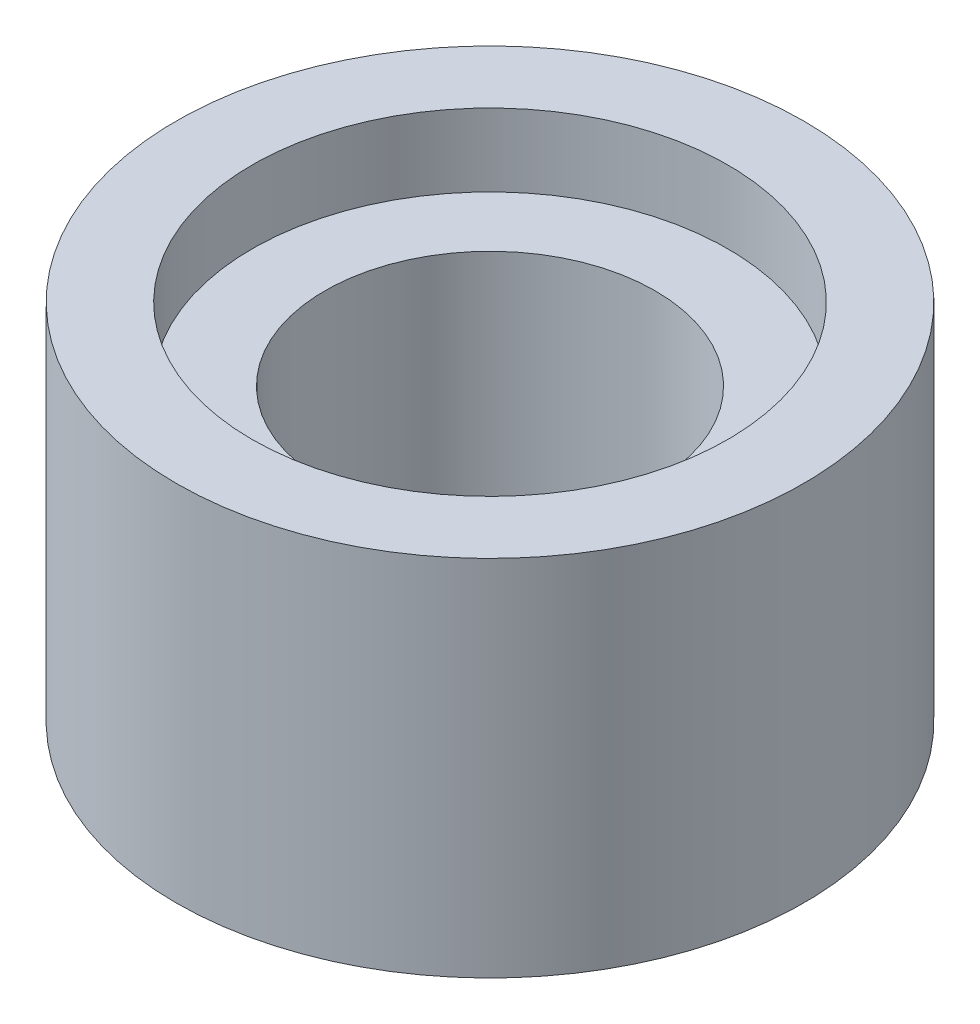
ISO-10303-21;
HEADER;
FILE_DESCRIPTION(('STEP AP214'),'2;1');
FILE_NAME('part.step','',(''),(''),'','','');
FILE_SCHEMA(('AUTOMOTIVE_DESIGN { 1 0 10303 214 1 1 1 1 }'));
ENDSEC;
DATA;
#1=APPLICATION_CONTEXT('core data for automotive mechanical design processes');
#2=APPLICATION_PROTOCOL_DEFINITION('international standard','automotive_design',2000,#1);
#3=PRODUCT_CONTEXT('',#1,'mechanical');
#4=PRODUCT('Part','Part','',(#3));
#5=PRODUCT_RELATED_PRODUCT_CATEGORY('part','',(#4));
#6=PRODUCT_DEFINITION_FORMATION('','',#4);
#7=PRODUCT_DEFINITION_CONTEXT('part definition',#1,'design');
#8=PRODUCT_DEFINITION('design','',#6,#7);
#9=PRODUCT_DEFINITION_SHAPE('','',#8);
#10=(LENGTH_UNIT() NAMED_UNIT(*) SI_UNIT(.MILLI.,.METRE.));
#11=(NAMED_UNIT(*) PLANE_ANGLE_UNIT() SI_UNIT($,.RADIAN.));
#12=(NAMED_UNIT(*) SI_UNIT($,.STERADIAN.) SOLID_ANGLE_UNIT());
#13=UNCERTAINTY_MEASURE_WITH_UNIT(LENGTH_MEASURE(1.E-05),#10,'distance_accuracy_value','');
#14=(GEOMETRIC_REPRESENTATION_CONTEXT(3) GLOBAL_UNCERTAINTY_ASSIGNED_CONTEXT((#13)) GLOBAL_UNIT_ASSIGNED_CONTEXT((#10,
#11,#12)) REPRESENTATION_CONTEXT('',''));
#15=CARTESIAN_POINT('',(0.,0.,0.));
#16=DIRECTION('',(0.,0.,1.));
#17=DIRECTION('',(1.,0.,0.));
#18=AXIS2_PLACEMENT_3D('',#15,#16,#17);
#19=CARTESIAN_POINT('',(0.,12.5747225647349,-0.134147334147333));
#20=DIRECTION('',(0.,1.,0.));
#21=DIRECTION('',(0.,0.,1.));
#22=AXIS2_PLACEMENT_3D('',#19,#20,#21);
#23=CYLINDRICAL_SURFACE('',#22,9.5);
#24=CARTESIAN_POINT('',(0.,0.,-0.134147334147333));
#25=DIRECTION('',(0.,1.,0.));
#26=DIRECTION('',(0.,0.,1.));
#27=AXIS2_PLACEMENT_3D('',#24,#25,#26);
#28=CIRCLE('',#27,9.5);
#29=CARTESIAN_POINT('',(0.,0.,9.36585266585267));
#30=VERTEX_POINT('',#29);
#31=EDGE_CURVE('E58',#30,#30,#28,.T.);
#32=ORIENTED_EDGE('',*,*,#31,.F.);
#33=EDGE_LOOP('',(#32));
#34=FACE_BOUND('',#33,.T.);
#35=CARTESIAN_POINT('',(0.,-11.,-0.134147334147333));
#36=DIRECTION('',(0.,1.,0.));
#37=DIRECTION('',(0.,0.,1.));
#38=AXIS2_PLACEMENT_3D('',#35,#36,#37);
#39=CIRCLE('',#38,9.5);
#40=CARTESIAN_POINT('',(0.,-11.,9.36585266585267));
#41=VERTEX_POINT('',#40);
#42=EDGE_CURVE('E10',#41,#41,#39,.T.);
#43=ORIENTED_EDGE('',*,*,#42,.T.);
#44=EDGE_LOOP('',(#43));
#45=FACE_BOUND('',#44,.T.);
#46=ADVANCED_FACE('F30',(#34,#45),#23,.T.);
#47=CARTESIAN_POINT('',(0.,-11.,-9.63414733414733));
#48=DIRECTION('',(0.,1.,0.));
#49=DIRECTION('',(0.,0.,1.));
#50=AXIS2_PLACEMENT_3D('',#47,#48,#49);
#51=PLANE('',#50);
#52=ORIENTED_EDGE('',*,*,#42,.F.);
#53=EDGE_LOOP('',(#52));
#54=FACE_BOUND('',#53,.T.);
#55=CARTESIAN_POINT('',(0.,-11.,-0.134147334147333));
#56=DIRECTION('',(0.,1.,0.));
#57=DIRECTION('',(0.,0.,1.));
#58=AXIS2_PLACEMENT_3D('',#55,#56,#57);
#59=CIRCLE('',#58,7.2);
#60=CARTESIAN_POINT('',(0.,-11.,7.06585266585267));
#61=VERTEX_POINT('',#60);
#62=EDGE_CURVE('E36',#61,#61,#59,.T.);
#63=ORIENTED_EDGE('',*,*,#62,.T.);
#64=EDGE_LOOP('',(#63));
#65=FACE_BOUND('',#64,.T.);
#66=ADVANCED_FACE('F65',(#54,#65),#51,.F.);
#67=CARTESIAN_POINT('',(0.,12.5747225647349,-0.134147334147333));
#68=DIRECTION('',(0.,1.,0.));
#69=DIRECTION('',(0.,0.,1.));
#70=AXIS2_PLACEMENT_3D('',#67,#68,#69);
#71=CYLINDRICAL_SURFACE('',#70,7.2);
#72=ORIENTED_EDGE('',*,*,#62,.F.);
#73=EDGE_LOOP('',(#72));
#74=FACE_BOUND('',#73,.T.);
#75=CARTESIAN_POINT('',(0.,-8.8,-0.134147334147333));
#76=DIRECTION('',(0.,1.,0.));
#77=DIRECTION('',(0.,0.,1.));
#78=AXIS2_PLACEMENT_3D('',#75,#76,#77);
#79=CIRCLE('',#78,7.2);
#80=CARTESIAN_POINT('',(0.,-8.8,7.06585266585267));
#81=VERTEX_POINT('',#80);
#82=EDGE_CURVE('E40',#81,#81,#79,.T.);
#83=ORIENTED_EDGE('',*,*,#82,.T.);
#84=EDGE_LOOP('',(#83));
#85=FACE_BOUND('',#84,.T.);
#86=ADVANCED_FACE('F69',(#74,#85),#71,.F.);
#87=CARTESIAN_POINT('',(0.,-8.8,-5.13414733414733));
#88=DIRECTION('',(0.,1.,0.));
#89=DIRECTION('',(0.,0.,1.));
#90=AXIS2_PLACEMENT_3D('',#87,#88,#89);
#91=PLANE('',#90);
#92=ORIENTED_EDGE('',*,*,#82,.F.);
#93=EDGE_LOOP('',(#92));
#94=FACE_BOUND('',#93,.T.);
#95=CARTESIAN_POINT('',(0.,-8.8,-0.134147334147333));
#96=DIRECTION('',(0.,1.,0.));
#97=DIRECTION('',(0.,0.,1.));
#98=AXIS2_PLACEMENT_3D('',#95,#96,#97);
#99=CIRCLE('',#98,5.);
#100=CARTESIAN_POINT('',(0.,-8.8,4.86585266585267));
#101=VERTEX_POINT('',#100);
#102=EDGE_CURVE('E44',#101,#101,#99,.T.);
#103=ORIENTED_EDGE('',*,*,#102,.T.);
#104=EDGE_LOOP('',(#103));
#105=FACE_BOUND('',#104,.T.);
#106=ADVANCED_FACE('F74',(#94,#105),#91,.F.);
#107=CARTESIAN_POINT('',(0.,12.5747225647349,-0.134147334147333));
#108=DIRECTION('',(0.,1.,0.));
#109=DIRECTION('',(0.,0.,1.));
#110=AXIS2_PLACEMENT_3D('',#107,#108,#109);
#111=CYLINDRICAL_SURFACE('',#110,5.);
#112=ORIENTED_EDGE('',*,*,#102,.F.);
#113=EDGE_LOOP('',(#112));
#114=FACE_BOUND('',#113,.T.);
#115=CARTESIAN_POINT('',(0.,-2.2,-0.134147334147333));
#116=DIRECTION('',(0.,1.,0.));
#117=DIRECTION('',(0.,0.,1.));
#118=AXIS2_PLACEMENT_3D('',#115,#116,#117);
#119=CIRCLE('',#118,5.);
#120=CARTESIAN_POINT('',(0.,-2.2,4.86585266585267));
#121=VERTEX_POINT('',#120);
#122=EDGE_CURVE('E49',#121,#121,#119,.T.);
#123=ORIENTED_EDGE('',*,*,#122,.T.);
#124=EDGE_LOOP('',(#123));
#125=FACE_BOUND('',#124,.T.);
#126=ADVANCED_FACE('F80',(#114,#125),#111,.F.);
#127=CARTESIAN_POINT('',(0.,-2.2,-7.33414733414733));
#128=DIRECTION('',(0.,-1.,0.));
#129=DIRECTION('',(0.,0.,-1.));
#130=AXIS2_PLACEMENT_3D('',#127,#128,#129);
#131=PLANE('',#130);
#132=ORIENTED_EDGE('',*,*,#122,.F.);
#133=EDGE_LOOP('',(#132));
#134=FACE_BOUND('',#133,.T.);
#135=CARTESIAN_POINT('',(0.,-2.2,-0.134147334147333));
#136=DIRECTION('',(0.,1.,0.));
#137=DIRECTION('',(0.,0.,1.));
#138=AXIS2_PLACEMENT_3D('',#135,#136,#137);
#139=CIRCLE('',#138,7.2);
#140=CARTESIAN_POINT('',(0.,-2.2,7.06585266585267));
#141=VERTEX_POINT('',#140);
#142=EDGE_CURVE('E52',#141,#141,#139,.T.);
#143=ORIENTED_EDGE('',*,*,#142,.T.);
#144=EDGE_LOOP('',(#143));
#145=FACE_BOUND('',#144,.T.);
#146=ADVANCED_FACE('F84',(#134,#145),#131,.F.);
#147=CARTESIAN_POINT('',(0.,12.5747225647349,-0.134147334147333));
#148=DIRECTION('',(0.,1.,0.));
#149=DIRECTION('',(0.,0.,1.));
#150=AXIS2_PLACEMENT_3D('',#147,#148,#149);
#151=CYLINDRICAL_SURFACE('',#150,7.2);
#152=ORIENTED_EDGE('',*,*,#142,.F.);
#153=EDGE_LOOP('',(#152));
#154=FACE_BOUND('',#153,.T.);
#155=CARTESIAN_POINT('',(0.,0.,-0.134147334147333));
#156=DIRECTION('',(0.,1.,0.));
#157=DIRECTION('',(0.,0.,1.));
#158=AXIS2_PLACEMENT_3D('',#155,#156,#157);
#159=CIRCLE('',#158,7.2);
#160=CARTESIAN_POINT('',(0.,0.,7.06585266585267));
#161=VERTEX_POINT('',#160);
#162=EDGE_CURVE('E55',#161,#161,#159,.T.);
#163=ORIENTED_EDGE('',*,*,#162,.T.);
#164=EDGE_LOOP('',(#163));
#165=FACE_BOUND('',#164,.T.);
#166=ADVANCED_FACE('F88',(#154,#165),#151,.F.);
#167=CARTESIAN_POINT('',(0.,0.,-7.33414733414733));
#168=DIRECTION('',(0.,-1.,0.));
#169=DIRECTION('',(0.,0.,-1.));
#170=AXIS2_PLACEMENT_3D('',#167,#168,#169);
#171=PLANE('',#170);
#172=ORIENTED_EDGE('',*,*,#162,.F.);
#173=EDGE_LOOP('',(#172));
#174=FACE_BOUND('',#173,.T.);
#175=ORIENTED_EDGE('',*,*,#31,.T.);
#176=EDGE_LOOP('',(#175));
#177=FACE_BOUND('',#176,.T.);
#178=ADVANCED_FACE('F62',(#174,#177),#171,.F.);
#179=CLOSED_SHELL('',(#46,#66,#86,#106,#126,#146,#166,#178));
#180=MANIFOLD_SOLID_BREP('B2',#179);
#181=ADVANCED_BREP_SHAPE_REPRESENTATION('',(#18,#180),#14);
#182=SHAPE_DEFINITION_REPRESENTATION(#9,#181);
ENDSEC;
END-ISO-10303-21;
